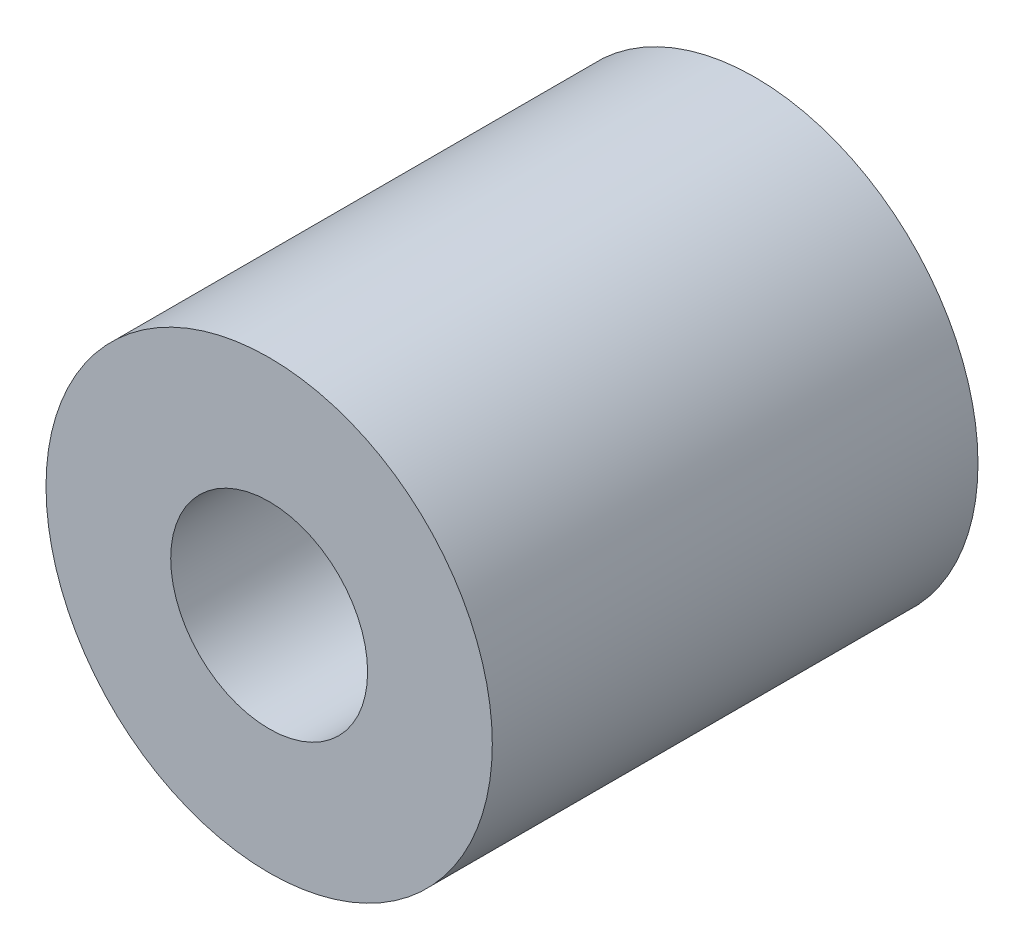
ISO-10303-21;
HEADER;
FILE_DESCRIPTION(('STEP AP214'),'2;1');
FILE_NAME('part.step','',(''),(''),'','','');
FILE_SCHEMA(('AUTOMOTIVE_DESIGN { 1 0 10303 214 1 1 1 1 }'));
ENDSEC;
DATA;
#1=APPLICATION_CONTEXT('core data for automotive mechanical design processes');
#2=APPLICATION_PROTOCOL_DEFINITION('international standard','automotive_design',2000,#1);
#3=PRODUCT_CONTEXT('',#1,'mechanical');
#4=PRODUCT('Part','Part','',(#3));
#5=PRODUCT_RELATED_PRODUCT_CATEGORY('part','',(#4));
#6=PRODUCT_DEFINITION_FORMATION('','',#4);
#7=PRODUCT_DEFINITION_CONTEXT('part definition',#1,'design');
#8=PRODUCT_DEFINITION('design','',#6,#7);
#9=PRODUCT_DEFINITION_SHAPE('','',#8);
#10=(LENGTH_UNIT() NAMED_UNIT(*) SI_UNIT(.MILLI.,.METRE.));
#11=(NAMED_UNIT(*) PLANE_ANGLE_UNIT() SI_UNIT($,.RADIAN.));
#12=(NAMED_UNIT(*) SI_UNIT($,.STERADIAN.) SOLID_ANGLE_UNIT());
#13=UNCERTAINTY_MEASURE_WITH_UNIT(LENGTH_MEASURE(1.E-05),#10,'distance_accuracy_value','');
#14=(GEOMETRIC_REPRESENTATION_CONTEXT(3) GLOBAL_UNCERTAINTY_ASSIGNED_CONTEXT((#13)) GLOBAL_UNIT_ASSIGNED_CONTEXT((#10,
#11,#12)) REPRESENTATION_CONTEXT('',''));
#15=CARTESIAN_POINT('',(0.,0.,0.));
#16=DIRECTION('',(0.,0.,1.));
#17=DIRECTION('',(1.,0.,0.));
#18=AXIS2_PLACEMENT_3D('',#15,#16,#17);
#19=CARTESIAN_POINT('',(0.,0.,18.796));
#20=DIRECTION('',(0.,0.,-1.));
#21=DIRECTION('',(-1.,0.,0.));
#22=AXIS2_PLACEMENT_3D('',#19,#20,#21);
#23=CYLINDRICAL_SURFACE('',#22,8.636);
#24=CARTESIAN_POINT('',(0.,0.,18.796));
#25=DIRECTION('',(0.,0.,1.));
#26=DIRECTION('',(1.,0.,0.));
#27=AXIS2_PLACEMENT_3D('',#24,#25,#26);
#28=CIRCLE('',#27,8.636);
#29=CARTESIAN_POINT('',(8.636,0.,18.796));
#30=VERTEX_POINT('',#29);
#31=EDGE_CURVE('E10',#30,#30,#28,.T.);
#32=ORIENTED_EDGE('',*,*,#31,.F.);
#33=EDGE_LOOP('',(#32));
#34=FACE_BOUND('',#33,.T.);
#35=CARTESIAN_POINT('',(0.,0.,0.));
#36=DIRECTION('',(0.,0.,1.));
#37=DIRECTION('',(1.,0.,0.));
#38=AXIS2_PLACEMENT_3D('',#35,#36,#37);
#39=CIRCLE('',#38,8.636);
#40=CARTESIAN_POINT('',(8.636,0.,0.));
#41=VERTEX_POINT('',#40);
#42=EDGE_CURVE('E32',#41,#41,#39,.T.);
#43=ORIENTED_EDGE('',*,*,#42,.T.);
#44=EDGE_LOOP('',(#43));
#45=FACE_BOUND('',#44,.T.);
#46=ADVANCED_FACE('F26',(#34,#45),#23,.T.);
#47=CARTESIAN_POINT('',(0.,0.,18.796));
#48=DIRECTION('',(0.,0.,1.));
#49=DIRECTION('',(1.,0.,0.));
#50=AXIS2_PLACEMENT_3D('',#47,#48,#49);
#51=PLANE('',#50);
#52=CARTESIAN_POINT('',(0.,0.,18.796));
#53=DIRECTION('',(0.,0.,1.));
#54=DIRECTION('',(1.,0.,0.));
#55=AXIS2_PLACEMENT_3D('',#52,#53,#54);
#56=CIRCLE('',#55,3.81);
#57=CARTESIAN_POINT('',(3.81,0.,18.796));
#58=VERTEX_POINT('',#57);
#59=EDGE_CURVE('E40',#58,#58,#56,.T.);
#60=ORIENTED_EDGE('',*,*,#59,.F.);
#61=EDGE_LOOP('',(#60));
#62=FACE_BOUND('',#61,.T.);
#63=ORIENTED_EDGE('',*,*,#31,.T.);
#64=EDGE_LOOP('',(#63));
#65=FACE_BOUND('',#64,.T.);
#66=ADVANCED_FACE('F48',(#62,#65),#51,.T.);
#67=CARTESIAN_POINT('',(0.,0.,0.));
#68=DIRECTION('',(0.,0.,1.));
#69=DIRECTION('',(1.,0.,0.));
#70=AXIS2_PLACEMENT_3D('',#67,#68,#69);
#71=PLANE('',#70);
#72=CARTESIAN_POINT('',(0.,0.,0.));
#73=DIRECTION('',(0.,0.,1.));
#74=DIRECTION('',(1.,0.,0.));
#75=AXIS2_PLACEMENT_3D('',#72,#73,#74);
#76=CIRCLE('',#75,3.81);
#77=CARTESIAN_POINT('',(3.81,0.,0.));
#78=VERTEX_POINT('',#77);
#79=EDGE_CURVE('E36',#78,#78,#76,.T.);
#80=ORIENTED_EDGE('',*,*,#79,.T.);
#81=EDGE_LOOP('',(#80));
#82=FACE_BOUND('',#81,.T.);
#83=ORIENTED_EDGE('',*,*,#42,.F.);
#84=EDGE_LOOP('',(#83));
#85=FACE_BOUND('',#84,.T.);
#86=ADVANCED_FACE('F50',(#82,#85),#71,.F.);
#87=CARTESIAN_POINT('',(0.,0.,0.));
#88=DIRECTION('',(0.,0.,1.));
#89=DIRECTION('',(1.,0.,0.));
#90=AXIS2_PLACEMENT_3D('',#87,#88,#89);
#91=CYLINDRICAL_SURFACE('',#90,3.81);
#92=ORIENTED_EDGE('',*,*,#79,.F.);
#93=EDGE_LOOP('',(#92));
#94=FACE_BOUND('',#93,.T.);
#95=ORIENTED_EDGE('',*,*,#59,.T.);
#96=EDGE_LOOP('',(#95));
#97=FACE_BOUND('',#96,.T.);
#98=ADVANCED_FACE('F46',(#94,#97),#91,.F.);
#99=CLOSED_SHELL('',(#46,#66,#86,#98));
#100=MANIFOLD_SOLID_BREP('B2',#99);
#101=ADVANCED_BREP_SHAPE_REPRESENTATION('',(#18,#100),#14);
#102=SHAPE_DEFINITION_REPRESENTATION(#9,#101);
ENDSEC;
END-ISO-10303-21;
